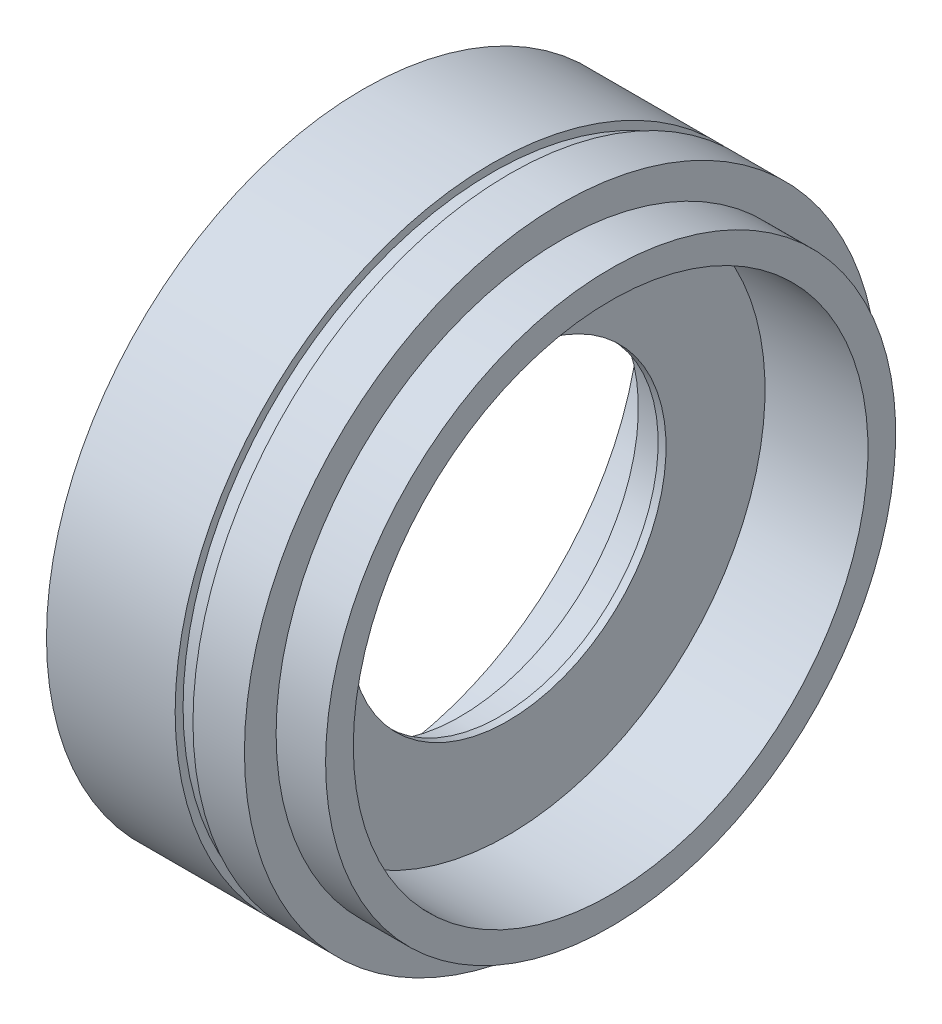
ISO-10303-21;
HEADER;
FILE_DESCRIPTION(('STEP AP214'),'2;1');
FILE_NAME('part.step','',(''),(''),'','','');
FILE_SCHEMA(('AUTOMOTIVE_DESIGN { 1 0 10303 214 1 1 1 1 }'));
ENDSEC;
DATA;
#1=APPLICATION_CONTEXT('core data for automotive mechanical design processes');
#2=APPLICATION_PROTOCOL_DEFINITION('international standard','automotive_design',2000,#1);
#3=PRODUCT_CONTEXT('',#1,'mechanical');
#4=PRODUCT('Part','Part','',(#3));
#5=PRODUCT_RELATED_PRODUCT_CATEGORY('part','',(#4));
#6=PRODUCT_DEFINITION_FORMATION('','',#4);
#7=PRODUCT_DEFINITION_CONTEXT('part definition',#1,'design');
#8=PRODUCT_DEFINITION('design','',#6,#7);
#9=PRODUCT_DEFINITION_SHAPE('','',#8);
#10=(LENGTH_UNIT() NAMED_UNIT(*) SI_UNIT(.MILLI.,.METRE.));
#11=(NAMED_UNIT(*) PLANE_ANGLE_UNIT() SI_UNIT($,.RADIAN.));
#12=(NAMED_UNIT(*) SI_UNIT($,.STERADIAN.) SOLID_ANGLE_UNIT());
#13=UNCERTAINTY_MEASURE_WITH_UNIT(LENGTH_MEASURE(1.E-05),#10,'distance_accuracy_value','');
#14=(GEOMETRIC_REPRESENTATION_CONTEXT(3) GLOBAL_UNCERTAINTY_ASSIGNED_CONTEXT((#13)) GLOBAL_UNIT_ASSIGNED_CONTEXT((#10,
#11,#12)) REPRESENTATION_CONTEXT('',''));
#15=CARTESIAN_POINT('',(0.,0.,0.));
#16=DIRECTION('',(0.,0.,1.));
#17=DIRECTION('',(1.,0.,0.));
#18=AXIS2_PLACEMENT_3D('',#15,#16,#17);
#19=CARTESIAN_POINT('',(0.,0.,0.));
#20=DIRECTION('',(-1.,0.,0.));
#21=DIRECTION('',(0.,0.,1.));
#22=AXIS2_PLACEMENT_3D('',#19,#20,#21);
#23=CYLINDRICAL_SURFACE('',#22,80.);
#24=CARTESIAN_POINT('',(0.,0.,0.));
#25=DIRECTION('',(-1.,0.,0.));
#26=DIRECTION('',(0.,0.,1.));
#27=AXIS2_PLACEMENT_3D('',#24,#25,#26);
#28=CIRCLE('',#27,80.);
#29=CARTESIAN_POINT('',(0.,0.,80.));
#30=VERTEX_POINT('',#29);
#31=EDGE_CURVE('E11',#30,#30,#28,.T.);
#32=ORIENTED_EDGE('',*,*,#31,.F.);
#33=EDGE_LOOP('',(#32));
#34=FACE_BOUND('',#33,.T.);
#35=CARTESIAN_POINT('',(32.5,0.,0.));
#36=DIRECTION('',(-1.,0.,0.));
#37=DIRECTION('',(0.,0.,1.));
#38=AXIS2_PLACEMENT_3D('',#35,#36,#37);
#39=CIRCLE('',#38,80.);
#40=CARTESIAN_POINT('',(32.5,0.,80.));
#41=VERTEX_POINT('',#40);
#42=EDGE_CURVE('E199',#41,#41,#39,.T.);
#43=ORIENTED_EDGE('',*,*,#42,.T.);
#44=EDGE_LOOP('',(#43));
#45=FACE_BOUND('',#44,.T.);
#46=ADVANCED_FACE('F35',(#34,#45),#23,.T.);
#47=CARTESIAN_POINT('',(50.,0.,0.));
#48=DIRECTION('',(-1.,0.,0.));
#49=DIRECTION('',(0.,0.,1.));
#50=AXIS2_PLACEMENT_3D('',#47,#48,#49);
#51=CIRCLE('',#50,80.);
#52=CARTESIAN_POINT('',(50.,0.,80.));
#53=VERTEX_POINT('',#52);
#54=EDGE_CURVE('E43',#53,#53,#51,.T.);
#55=ORIENTED_EDGE('',*,*,#54,.T.);
#56=EDGE_LOOP('',(#55));
#57=FACE_BOUND('',#56,.T.);
#58=CARTESIAN_POINT('',(37.,0.,0.));
#59=DIRECTION('',(-1.,0.,0.));
#60=DIRECTION('',(0.,0.,1.));
#61=AXIS2_PLACEMENT_3D('',#58,#59,#60);
#62=CIRCLE('',#61,80.);
#63=CARTESIAN_POINT('',(37.,0.,80.));
#64=VERTEX_POINT('',#63);
#65=EDGE_CURVE('E201',#64,#64,#62,.T.);
#66=ORIENTED_EDGE('',*,*,#65,.F.);
#67=EDGE_LOOP('',(#66));
#68=FACE_BOUND('',#67,.T.);
#69=ADVANCED_FACE('F126',(#57,#68),#23,.T.);
#70=CARTESIAN_POINT('',(0.,70.,0.));
#71=DIRECTION('',(1.,0.,0.));
#72=DIRECTION('',(0.,0.,-1.));
#73=AXIS2_PLACEMENT_3D('',#70,#71,#72);
#74=PLANE('',#73);
#75=CARTESIAN_POINT('',(0.,7.85583756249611E-13,-75.));
#76=DIRECTION('',(-1.,0.,0.));
#77=DIRECTION('',(0.,0.,1.));
#78=AXIS2_PLACEMENT_3D('',#75,#76,#77);
#79=CIRCLE('',#78,3.3);
#80=CARTESIAN_POINT('',(0.,7.85583756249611E-13,-71.7));
#81=VERTEX_POINT('',#80);
#82=EDGE_CURVE('E66',#81,#81,#79,.T.);
#83=ORIENTED_EDGE('',*,*,#82,.F.);
#84=EDGE_LOOP('',(#83));
#85=FACE_BOUND('',#84,.T.);
#86=CARTESIAN_POINT('',(0.,-75.,-5.23722504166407E-13));
#87=DIRECTION('',(-1.,0.,0.));
#88=DIRECTION('',(0.,0.,1.));
#89=AXIS2_PLACEMENT_3D('',#86,#87,#88);
#90=CIRCLE('',#89,3.3);
#91=CARTESIAN_POINT('',(0.,-75.,3.29999999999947));
#92=VERTEX_POINT('',#91);
#93=EDGE_CURVE('E79',#92,#92,#90,.T.);
#94=ORIENTED_EDGE('',*,*,#93,.F.);
#95=EDGE_LOOP('',(#94));
#96=FACE_BOUND('',#95,.T.);
#97=CARTESIAN_POINT('',(0.,-2.61861252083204E-13,75.));
#98=DIRECTION('',(-1.,0.,0.));
#99=DIRECTION('',(0.,0.,1.));
#100=AXIS2_PLACEMENT_3D('',#97,#98,#99);
#101=CIRCLE('',#100,3.3);
#102=CARTESIAN_POINT('',(0.,-2.61861252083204E-13,78.3));
#103=VERTEX_POINT('',#102);
#104=EDGE_CURVE('E85',#103,#103,#101,.T.);
#105=ORIENTED_EDGE('',*,*,#104,.F.);
#106=EDGE_LOOP('',(#105));
#107=FACE_BOUND('',#106,.T.);
#108=CARTESIAN_POINT('',(0.,75.,0.));
#109=DIRECTION('',(-1.,0.,0.));
#110=DIRECTION('',(0.,0.,1.));
#111=AXIS2_PLACEMENT_3D('',#108,#109,#110);
#112=CIRCLE('',#111,3.3);
#113=CARTESIAN_POINT('',(0.,75.,3.3));
#114=VERTEX_POINT('',#113);
#115=EDGE_CURVE('E91',#114,#114,#112,.T.);
#116=ORIENTED_EDGE('',*,*,#115,.F.);
#117=EDGE_LOOP('',(#116));
#118=FACE_BOUND('',#117,.T.);
#119=CARTESIAN_POINT('',(0.,0.,0.));
#120=DIRECTION('',(-1.,0.,0.));
#121=DIRECTION('',(0.,0.,1.));
#122=AXIS2_PLACEMENT_3D('',#119,#120,#121);
#123=CIRCLE('',#122,70.);
#124=CARTESIAN_POINT('',(0.,0.,70.));
#125=VERTEX_POINT('',#124);
#126=EDGE_CURVE('E94',#125,#125,#123,.T.);
#127=ORIENTED_EDGE('',*,*,#126,.F.);
#128=EDGE_LOOP('',(#127));
#129=FACE_BOUND('',#128,.T.);
#130=ORIENTED_EDGE('',*,*,#31,.T.);
#131=EDGE_LOOP('',(#130));
#132=FACE_BOUND('',#131,.T.);
#133=ADVANCED_FACE('F37',(#85,#96,#107,#118,#129,#132),#74,.F.);
#134=CARTESIAN_POINT('',(50.,80.,0.));
#135=DIRECTION('',(-1.,0.,0.));
#136=DIRECTION('',(0.,0.,1.));
#137=AXIS2_PLACEMENT_3D('',#134,#135,#136);
#138=PLANE('',#137);
#139=ORIENTED_EDGE('',*,*,#54,.F.);
#140=EDGE_LOOP('',(#139));
#141=FACE_BOUND('',#140,.T.);
#142=CARTESIAN_POINT('',(50.,0.,0.));
#143=DIRECTION('',(-1.,0.,0.));
#144=DIRECTION('',(0.,0.,1.));
#145=AXIS2_PLACEMENT_3D('',#142,#143,#144);
#146=CIRCLE('',#145,72.);
#147=CARTESIAN_POINT('',(50.,0.,72.));
#148=VERTEX_POINT('',#147);
#149=EDGE_CURVE('E121',#148,#148,#146,.T.);
#150=ORIENTED_EDGE('',*,*,#149,.T.);
#151=EDGE_LOOP('',(#150));
#152=FACE_BOUND('',#151,.T.);
#153=ADVANCED_FACE('F129',(#141,#152),#138,.F.);
#154=CARTESIAN_POINT('',(0.,0.,0.));
#155=DIRECTION('',(-1.,0.,0.));
#156=DIRECTION('',(0.,0.,1.));
#157=AXIS2_PLACEMENT_3D('',#154,#155,#156);
#158=CYLINDRICAL_SURFACE('',#157,72.);
#159=ORIENTED_EDGE('',*,*,#149,.F.);
#160=EDGE_LOOP('',(#159));
#161=FACE_BOUND('',#160,.T.);
#162=CARTESIAN_POINT('',(62.5,0.,0.));
#163=DIRECTION('',(-1.,0.,0.));
#164=DIRECTION('',(0.,0.,1.));
#165=AXIS2_PLACEMENT_3D('',#162,#163,#164);
#166=CIRCLE('',#165,72.);
#167=CARTESIAN_POINT('',(62.5,0.,72.));
#168=VERTEX_POINT('',#167);
#169=EDGE_CURVE('E118',#168,#168,#166,.T.);
#170=ORIENTED_EDGE('',*,*,#169,.T.);
#171=EDGE_LOOP('',(#170));
#172=FACE_BOUND('',#171,.T.);
#173=ADVANCED_FACE('F132',(#161,#172),#158,.T.);
#174=CARTESIAN_POINT('',(62.5,72.,0.));
#175=DIRECTION('',(-1.,0.,0.));
#176=DIRECTION('',(0.,0.,1.));
#177=AXIS2_PLACEMENT_3D('',#174,#175,#176);
#178=PLANE('',#177);
#179=ORIENTED_EDGE('',*,*,#169,.F.);
#180=EDGE_LOOP('',(#179));
#181=FACE_BOUND('',#180,.T.);
#182=CARTESIAN_POINT('',(62.5,0.,0.));
#183=DIRECTION('',(-1.,0.,0.));
#184=DIRECTION('',(0.,0.,1.));
#185=AXIS2_PLACEMENT_3D('',#182,#183,#184);
#186=CIRCLE('',#185,65.);
#187=CARTESIAN_POINT('',(62.5,0.,65.));
#188=VERTEX_POINT('',#187);
#189=EDGE_CURVE('E115',#188,#188,#186,.T.);
#190=ORIENTED_EDGE('',*,*,#189,.T.);
#191=EDGE_LOOP('',(#190));
#192=FACE_BOUND('',#191,.T.);
#193=ADVANCED_FACE('F138',(#181,#192),#178,.F.);
#194=CARTESIAN_POINT('',(0.,0.,0.));
#195=DIRECTION('',(-1.,0.,0.));
#196=DIRECTION('',(0.,0.,1.));
#197=AXIS2_PLACEMENT_3D('',#194,#195,#196);
#198=CYLINDRICAL_SURFACE('',#197,65.);
#199=ORIENTED_EDGE('',*,*,#189,.F.);
#200=EDGE_LOOP('',(#199));
#201=FACE_BOUND('',#200,.T.);
#202=CARTESIAN_POINT('',(36.5,0.,0.));
#203=DIRECTION('',(-1.,0.,0.));
#204=DIRECTION('',(0.,0.,1.));
#205=AXIS2_PLACEMENT_3D('',#202,#203,#204);
#206=CIRCLE('',#205,65.);
#207=CARTESIAN_POINT('',(36.5,0.,65.));
#208=VERTEX_POINT('',#207);
#209=EDGE_CURVE('E112',#208,#208,#206,.T.);
#210=ORIENTED_EDGE('',*,*,#209,.T.);
#211=EDGE_LOOP('',(#210));
#212=FACE_BOUND('',#211,.T.);
#213=ADVANCED_FACE('F144',(#201,#212),#198,.F.);
#214=CARTESIAN_POINT('',(36.5,65.,0.));
#215=DIRECTION('',(-1.,0.,0.));
#216=DIRECTION('',(0.,0.,1.));
#217=AXIS2_PLACEMENT_3D('',#214,#215,#216);
#218=PLANE('',#217);
#219=ORIENTED_EDGE('',*,*,#209,.F.);
#220=EDGE_LOOP('',(#219));
#221=FACE_BOUND('',#220,.T.);
#222=CARTESIAN_POINT('',(36.5,0.,0.));
#223=DIRECTION('',(-1.,0.,0.));
#224=DIRECTION('',(0.,0.,1.));
#225=AXIS2_PLACEMENT_3D('',#222,#223,#224);
#226=CIRCLE('',#225,40.);
#227=CARTESIAN_POINT('',(36.5,0.,40.));
#228=VERTEX_POINT('',#227);
#229=EDGE_CURVE('E109',#228,#228,#226,.T.);
#230=ORIENTED_EDGE('',*,*,#229,.T.);
#231=EDGE_LOOP('',(#230));
#232=FACE_BOUND('',#231,.T.);
#233=ADVANCED_FACE('F150',(#221,#232),#218,.F.);
#234=CARTESIAN_POINT('',(0.,0.,0.));
#235=DIRECTION('',(-1.,0.,0.));
#236=DIRECTION('',(0.,0.,1.));
#237=AXIS2_PLACEMENT_3D('',#234,#235,#236);
#238=CYLINDRICAL_SURFACE('',#237,40.);
#239=ORIENTED_EDGE('',*,*,#229,.F.);
#240=EDGE_LOOP('',(#239));
#241=FACE_BOUND('',#240,.T.);
#242=CARTESIAN_POINT('',(34.5,0.,0.));
#243=DIRECTION('',(-1.,0.,0.));
#244=DIRECTION('',(0.,0.,1.));
#245=AXIS2_PLACEMENT_3D('',#242,#243,#244);
#246=CIRCLE('',#245,40.);
#247=CARTESIAN_POINT('',(34.5,0.,40.));
#248=VERTEX_POINT('',#247);
#249=EDGE_CURVE('E106',#248,#248,#246,.T.);
#250=ORIENTED_EDGE('',*,*,#249,.T.);
#251=EDGE_LOOP('',(#250));
#252=FACE_BOUND('',#251,.T.);
#253=ADVANCED_FACE('F156',(#241,#252),#238,.F.);
#254=CARTESIAN_POINT('',(34.5,40.,0.));
#255=DIRECTION('',(1.,0.,0.));
#256=DIRECTION('',(0.,0.,-1.));
#257=AXIS2_PLACEMENT_3D('',#254,#255,#256);
#258=PLANE('',#257);
#259=ORIENTED_EDGE('',*,*,#249,.F.);
#260=EDGE_LOOP('',(#259));
#261=FACE_BOUND('',#260,.T.);
#262=CARTESIAN_POINT('',(34.5,0.,0.));
#263=DIRECTION('',(-1.,0.,0.));
#264=DIRECTION('',(0.,0.,1.));
#265=AXIS2_PLACEMENT_3D('',#262,#263,#264);
#266=CIRCLE('',#265,45.);
#267=CARTESIAN_POINT('',(34.5,0.,45.));
#268=VERTEX_POINT('',#267);
#269=EDGE_CURVE('E103',#268,#268,#266,.T.);
#270=ORIENTED_EDGE('',*,*,#269,.T.);
#271=EDGE_LOOP('',(#270));
#272=FACE_BOUND('',#271,.T.);
#273=ADVANCED_FACE('F162',(#261,#272),#258,.F.);
#274=CARTESIAN_POINT('',(0.,0.,0.));
#275=DIRECTION('',(-1.,0.,0.));
#276=DIRECTION('',(0.,0.,1.));
#277=AXIS2_PLACEMENT_3D('',#274,#275,#276);
#278=CYLINDRICAL_SURFACE('',#277,45.);
#279=ORIENTED_EDGE('',*,*,#269,.F.);
#280=EDGE_LOOP('',(#279));
#281=FACE_BOUND('',#280,.T.);
#282=CARTESIAN_POINT('',(24.5,0.,0.));
#283=DIRECTION('',(-1.,0.,0.));
#284=DIRECTION('',(0.,0.,1.));
#285=AXIS2_PLACEMENT_3D('',#282,#283,#284);
#286=CIRCLE('',#285,45.);
#287=CARTESIAN_POINT('',(24.5,0.,45.));
#288=VERTEX_POINT('',#287);
#289=EDGE_CURVE('E100',#288,#288,#286,.T.);
#290=ORIENTED_EDGE('',*,*,#289,.T.);
#291=EDGE_LOOP('',(#290));
#292=FACE_BOUND('',#291,.T.);
#293=ADVANCED_FACE('F168',(#281,#292),#278,.F.);
#294=CARTESIAN_POINT('',(24.5,45.,0.));
#295=DIRECTION('',(1.,0.,0.));
#296=DIRECTION('',(0.,0.,-1.));
#297=AXIS2_PLACEMENT_3D('',#294,#295,#296);
#298=PLANE('',#297);
#299=ORIENTED_EDGE('',*,*,#289,.F.);
#300=EDGE_LOOP('',(#299));
#301=FACE_BOUND('',#300,.T.);
#302=CARTESIAN_POINT('',(24.5,0.,0.));
#303=DIRECTION('',(-1.,0.,0.));
#304=DIRECTION('',(0.,0.,1.));
#305=AXIS2_PLACEMENT_3D('',#302,#303,#304);
#306=CIRCLE('',#305,70.);
#307=CARTESIAN_POINT('',(24.5,0.,70.));
#308=VERTEX_POINT('',#307);
#309=EDGE_CURVE('E97',#308,#308,#306,.T.);
#310=ORIENTED_EDGE('',*,*,#309,.T.);
#311=EDGE_LOOP('',(#310));
#312=FACE_BOUND('',#311,.T.);
#313=ADVANCED_FACE('F174',(#301,#312),#298,.F.);
#314=CARTESIAN_POINT('',(0.,0.,0.));
#315=DIRECTION('',(-1.,0.,0.));
#316=DIRECTION('',(0.,0.,1.));
#317=AXIS2_PLACEMENT_3D('',#314,#315,#316);
#318=CYLINDRICAL_SURFACE('',#317,70.);
#319=ORIENTED_EDGE('',*,*,#309,.F.);
#320=EDGE_LOOP('',(#319));
#321=FACE_BOUND('',#320,.T.);
#322=ORIENTED_EDGE('',*,*,#126,.T.);
#323=EDGE_LOOP('',(#322));
#324=FACE_BOUND('',#323,.T.);
#325=ADVANCED_FACE('F180',(#321,#324),#318,.F.);
#326=CARTESIAN_POINT('',(0.,75.,0.));
#327=DIRECTION('',(-1.,0.,0.));
#328=DIRECTION('',(0.,0.,1.));
#329=AXIS2_PLACEMENT_3D('',#326,#327,#328);
#330=CYLINDRICAL_SURFACE('',#329,3.3);
#331=CARTESIAN_POINT('',(10.,75.,0.));
#332=DIRECTION('',(-1.,0.,0.));
#333=DIRECTION('',(0.,0.,1.));
#334=AXIS2_PLACEMENT_3D('',#331,#332,#333);
#335=CIRCLE('',#334,3.3);
#336=CARTESIAN_POINT('',(10.,75.,3.3));
#337=VERTEX_POINT('',#336);
#338=EDGE_CURVE('E88',#337,#337,#335,.T.);
#339=ORIENTED_EDGE('',*,*,#338,.F.);
#340=EDGE_LOOP('',(#339));
#341=FACE_BOUND('',#340,.T.);
#342=ORIENTED_EDGE('',*,*,#115,.T.);
#343=EDGE_LOOP('',(#342));
#344=FACE_BOUND('',#343,.T.);
#345=ADVANCED_FACE('F186',(#341,#344),#330,.F.);
#346=CARTESIAN_POINT('',(10.,75.,0.));
#347=DIRECTION('',(-1.,0.,0.));
#348=DIRECTION('',(0.,0.,1.));
#349=AXIS2_PLACEMENT_3D('',#346,#347,#348);
#350=CONICAL_SURFACE('',#349,3.3,1.02974425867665);
#351=CARTESIAN_POINT('',(11.9828400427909,75.,0.));
#352=VERTEX_POINT('',#351);
#353=VERTEX_LOOP('',#352);
#354=FACE_BOUND('',#353,.T.);
#355=ORIENTED_EDGE('',*,*,#338,.T.);
#356=EDGE_LOOP('',(#355));
#357=FACE_BOUND('',#356,.T.);
#358=ADVANCED_FACE('F239',(#354,#357),#350,.F.);
#359=CARTESIAN_POINT('',(0.,-2.61861252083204E-13,75.));
#360=DIRECTION('',(-1.,0.,0.));
#361=DIRECTION('',(0.,0.,1.));
#362=AXIS2_PLACEMENT_3D('',#359,#360,#361);
#363=CYLINDRICAL_SURFACE('',#362,3.3);
#364=CARTESIAN_POINT('',(10.,-2.61861252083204E-13,75.));
#365=DIRECTION('',(-1.,0.,0.));
#366=DIRECTION('',(0.,0.,1.));
#367=AXIS2_PLACEMENT_3D('',#364,#365,#366);
#368=CIRCLE('',#367,3.3);
#369=CARTESIAN_POINT('',(10.,-2.61861252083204E-13,78.3));
#370=VERTEX_POINT('',#369);
#371=EDGE_CURVE('E82',#370,#370,#368,.T.);
#372=ORIENTED_EDGE('',*,*,#371,.F.);
#373=EDGE_LOOP('',(#372));
#374=FACE_BOUND('',#373,.T.);
#375=ORIENTED_EDGE('',*,*,#104,.T.);
#376=EDGE_LOOP('',(#375));
#377=FACE_BOUND('',#376,.T.);
#378=ADVANCED_FACE('F236',(#374,#377),#363,.F.);
#379=CARTESIAN_POINT('',(10.,-2.61861252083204E-13,75.));
#380=DIRECTION('',(-1.,0.,0.));
#381=DIRECTION('',(0.,0.,1.));
#382=AXIS2_PLACEMENT_3D('',#379,#380,#381);
#383=CONICAL_SURFACE('',#382,3.3,1.02974425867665);
#384=CARTESIAN_POINT('',(11.9828400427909,-2.64342108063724E-13,75.));
#385=VERTEX_POINT('',#384);
#386=VERTEX_LOOP('',#385);
#387=FACE_BOUND('',#386,.T.);
#388=ORIENTED_EDGE('',*,*,#371,.T.);
#389=EDGE_LOOP('',(#388));
#390=FACE_BOUND('',#389,.T.);
#391=ADVANCED_FACE('F232',(#387,#390),#383,.F.);
#392=CARTESIAN_POINT('',(0.,-75.,-5.23722504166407E-13));
#393=DIRECTION('',(-1.,0.,0.));
#394=DIRECTION('',(0.,0.,1.));
#395=AXIS2_PLACEMENT_3D('',#392,#393,#394);
#396=CYLINDRICAL_SURFACE('',#395,3.3);
#397=CARTESIAN_POINT('',(10.,-75.,-5.23722504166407E-13));
#398=DIRECTION('',(-1.,0.,0.));
#399=DIRECTION('',(0.,0.,1.));
#400=AXIS2_PLACEMENT_3D('',#397,#398,#399);
#401=CIRCLE('',#400,3.3);
#402=CARTESIAN_POINT('',(10.,-75.,3.29999999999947));
#403=VERTEX_POINT('',#402);
#404=EDGE_CURVE('E70',#403,#403,#401,.T.);
#405=ORIENTED_EDGE('',*,*,#404,.F.);
#406=EDGE_LOOP('',(#405));
#407=FACE_BOUND('',#406,.T.);
#408=ORIENTED_EDGE('',*,*,#93,.T.);
#409=EDGE_LOOP('',(#408));
#410=FACE_BOUND('',#409,.T.);
#411=ADVANCED_FACE('F228',(#407,#410),#396,.F.);
#412=CARTESIAN_POINT('',(10.,-75.,-5.23722504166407E-13));
#413=DIRECTION('',(-1.,0.,0.));
#414=DIRECTION('',(0.,0.,1.));
#415=AXIS2_PLACEMENT_3D('',#412,#413,#414);
#416=CONICAL_SURFACE('',#415,3.3,1.02974425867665);
#417=CARTESIAN_POINT('',(11.9828400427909,-75.,-5.23722504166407E-13));
#418=VERTEX_POINT('',#417);
#419=VERTEX_LOOP('',#418);
#420=FACE_BOUND('',#419,.T.);
#421=ORIENTED_EDGE('',*,*,#404,.T.);
#422=EDGE_LOOP('',(#421));
#423=FACE_BOUND('',#422,.T.);
#424=ADVANCED_FACE('F225',(#420,#423),#416,.F.);
#425=CARTESIAN_POINT('',(0.,7.85583756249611E-13,-75.));
#426=DIRECTION('',(-1.,0.,0.));
#427=DIRECTION('',(0.,0.,1.));
#428=AXIS2_PLACEMENT_3D('',#425,#426,#427);
#429=CYLINDRICAL_SURFACE('',#428,3.3);
#430=CARTESIAN_POINT('',(10.,7.85583756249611E-13,-75.));
#431=DIRECTION('',(-1.,0.,0.));
#432=DIRECTION('',(0.,0.,1.));
#433=AXIS2_PLACEMENT_3D('',#430,#431,#432);
#434=CIRCLE('',#433,3.3);
#435=CARTESIAN_POINT('',(10.,7.85583756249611E-13,-71.7));
#436=VERTEX_POINT('',#435);
#437=EDGE_CURVE('E64',#436,#436,#434,.T.);
#438=ORIENTED_EDGE('',*,*,#437,.F.);
#439=EDGE_LOOP('',(#438));
#440=FACE_BOUND('',#439,.T.);
#441=ORIENTED_EDGE('',*,*,#82,.T.);
#442=EDGE_LOOP('',(#441));
#443=FACE_BOUND('',#442,.T.);
#444=ADVANCED_FACE('F60',(#440,#443),#429,.F.);
#445=CARTESIAN_POINT('',(10.,7.85583756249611E-13,-75.));
#446=DIRECTION('',(-1.,0.,0.));
#447=DIRECTION('',(0.,0.,1.));
#448=AXIS2_PLACEMENT_3D('',#445,#446,#447);
#449=CONICAL_SURFACE('',#448,3.3,1.02974425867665);
#450=CARTESIAN_POINT('',(11.9828400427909,7.83102900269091E-13,-75.));
#451=VERTEX_POINT('',#450);
#452=VERTEX_LOOP('',#451);
#453=FACE_BOUND('',#452,.T.);
#454=ORIENTED_EDGE('',*,*,#437,.T.);
#455=EDGE_LOOP('',(#454));
#456=FACE_BOUND('',#455,.T.);
#457=ADVANCED_FACE('F56',(#453,#456),#449,.F.);
#458=CARTESIAN_POINT('',(32.5,80.,0.));
#459=DIRECTION('',(1.,0.,0.));
#460=DIRECTION('',(0.,0.,-1.));
#461=AXIS2_PLACEMENT_3D('',#458,#459,#460);
#462=PLANE('',#461);
#463=CARTESIAN_POINT('',(32.5,0.,0.));
#464=DIRECTION('',(-1.,0.,0.));
#465=DIRECTION('',(0.,0.,1.));
#466=AXIS2_PLACEMENT_3D('',#463,#464,#465);
#467=CIRCLE('',#466,78.);
#468=CARTESIAN_POINT('',(32.5,0.,78.));
#469=VERTEX_POINT('',#468);
#470=EDGE_CURVE('E67',#469,#469,#467,.T.);
#471=ORIENTED_EDGE('',*,*,#470,.T.);
#472=EDGE_LOOP('',(#471));
#473=FACE_BOUND('',#472,.T.);
#474=ORIENTED_EDGE('',*,*,#42,.F.);
#475=EDGE_LOOP('',(#474));
#476=FACE_BOUND('',#475,.T.);
#477=ADVANCED_FACE('F59',(#473,#476),#462,.T.);
#478=CARTESIAN_POINT('',(0.,0.,0.));
#479=DIRECTION('',(-1.,0.,0.));
#480=DIRECTION('',(0.,0.,1.));
#481=AXIS2_PLACEMENT_3D('',#478,#479,#480);
#482=CYLINDRICAL_SURFACE('',#481,78.);
#483=CARTESIAN_POINT('',(37.,0.,0.));
#484=DIRECTION('',(-1.,0.,0.));
#485=DIRECTION('',(0.,0.,1.));
#486=AXIS2_PLACEMENT_3D('',#483,#484,#485);
#487=CIRCLE('',#486,78.);
#488=CARTESIAN_POINT('',(37.,0.,78.));
#489=VERTEX_POINT('',#488);
#490=EDGE_CURVE('E73',#489,#489,#487,.T.);
#491=ORIENTED_EDGE('',*,*,#490,.T.);
#492=EDGE_LOOP('',(#491));
#493=FACE_BOUND('',#492,.T.);
#494=ORIENTED_EDGE('',*,*,#470,.F.);
#495=EDGE_LOOP('',(#494));
#496=FACE_BOUND('',#495,.T.);
#497=ADVANCED_FACE('F208',(#493,#496),#482,.T.);
#498=CARTESIAN_POINT('',(37.,80.,0.));
#499=DIRECTION('',(-1.,0.,0.));
#500=DIRECTION('',(0.,0.,1.));
#501=AXIS2_PLACEMENT_3D('',#498,#499,#500);
#502=PLANE('',#501);
#503=ORIENTED_EDGE('',*,*,#65,.T.);
#504=EDGE_LOOP('',(#503));
#505=FACE_BOUND('',#504,.T.);
#506=ORIENTED_EDGE('',*,*,#490,.F.);
#507=EDGE_LOOP('',(#506));
#508=FACE_BOUND('',#507,.T.);
#509=ADVANCED_FACE('F211',(#505,#508),#502,.T.);
#510=CLOSED_SHELL('',(#46,#69,#133,#153,#173,#193,#213,#233,#253,#273,#293,#313,#325,#345,#358,
#378,#391,#411,#424,#444,#457,#477,#497,#509));
#511=MANIFOLD_SOLID_BREP('B2',#510);
#512=ADVANCED_BREP_SHAPE_REPRESENTATION('',(#18,#511),#14);
#513=SHAPE_DEFINITION_REPRESENTATION(#9,#512);
ENDSEC;
END-ISO-10303-21;
